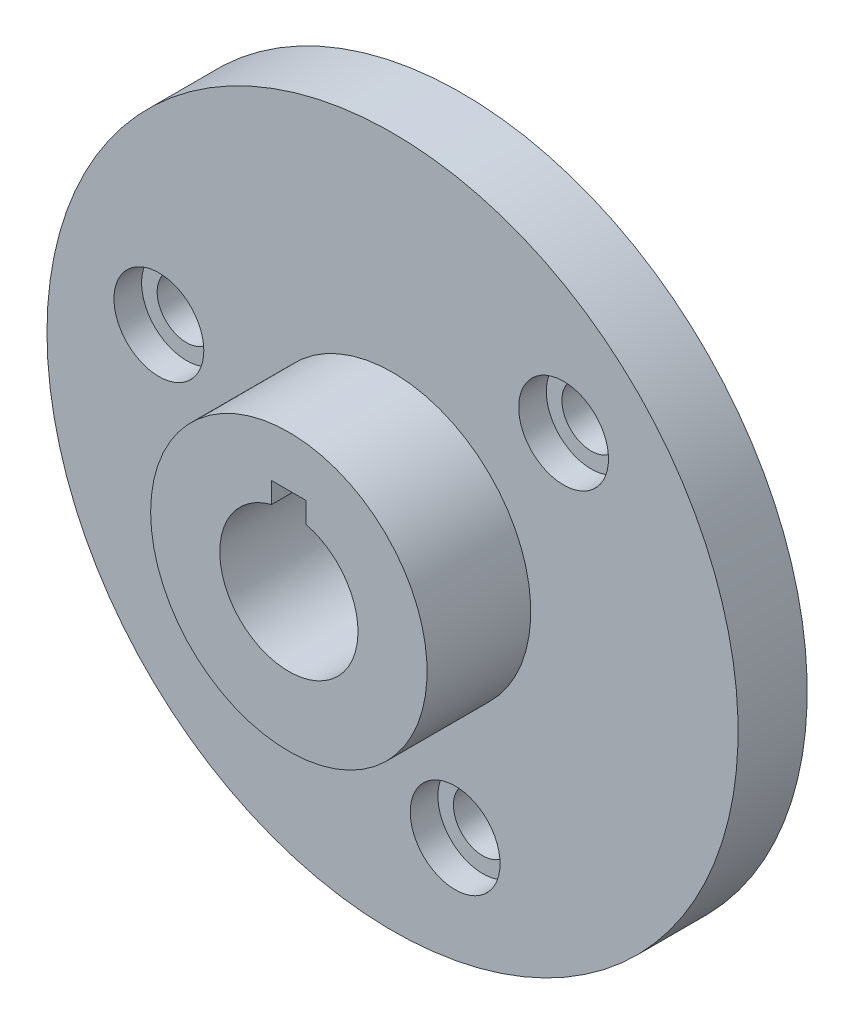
ISO-10303-21;
HEADER;
FILE_DESCRIPTION(('STEP AP214'),'2;1');
FILE_NAME('part.step','',(''),(''),'','','');
FILE_SCHEMA(('AUTOMOTIVE_DESIGN { 1 0 10303 214 1 1 1 1 }'));
ENDSEC;
DATA;
#1=APPLICATION_CONTEXT('core data for automotive mechanical design processes');
#2=APPLICATION_PROTOCOL_DEFINITION('international standard','automotive_design',2000,#1);
#3=PRODUCT_CONTEXT('',#1,'mechanical');
#4=PRODUCT('Part','Part','',(#3));
#5=PRODUCT_RELATED_PRODUCT_CATEGORY('part','',(#4));
#6=PRODUCT_DEFINITION_FORMATION('','',#4);
#7=PRODUCT_DEFINITION_CONTEXT('part definition',#1,'design');
#8=PRODUCT_DEFINITION('design','',#6,#7);
#9=PRODUCT_DEFINITION_SHAPE('','',#8);
#10=(LENGTH_UNIT() NAMED_UNIT(*) SI_UNIT(.MILLI.,.METRE.));
#11=(NAMED_UNIT(*) PLANE_ANGLE_UNIT() SI_UNIT($,.RADIAN.));
#12=(NAMED_UNIT(*) SI_UNIT($,.STERADIAN.) SOLID_ANGLE_UNIT());
#13=UNCERTAINTY_MEASURE_WITH_UNIT(LENGTH_MEASURE(1.E-05),#10,'distance_accuracy_value','');
#14=(GEOMETRIC_REPRESENTATION_CONTEXT(3) GLOBAL_UNCERTAINTY_ASSIGNED_CONTEXT((#13)) GLOBAL_UNIT_ASSIGNED_CONTEXT((#10,
#11,#12)) REPRESENTATION_CONTEXT('',''));
#15=CARTESIAN_POINT('',(0.,0.,0.));
#16=DIRECTION('',(0.,0.,1.));
#17=DIRECTION('',(1.,0.,0.));
#18=AXIS2_PLACEMENT_3D('',#15,#16,#17);
#19=CARTESIAN_POINT('',(0.,0.,0.));
#20=DIRECTION('',(0.,0.,-1.));
#21=DIRECTION('',(-1.,0.,0.));
#22=AXIS2_PLACEMENT_3D('',#19,#20,#21);
#23=PLANE('',#22);
#24=CARTESIAN_POINT('',(0.,0.,0.));
#25=DIRECTION('',(0.,0.,1.));
#26=DIRECTION('',(1.,0.,0.));
#27=AXIS2_PLACEMENT_3D('',#24,#25,#26);
#28=CIRCLE('',#27,10.);
#29=CARTESIAN_POINT('',(-2.5,9.68245836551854,0.));
#30=VERTEX_POINT('',#29);
#31=CARTESIAN_POINT('',(2.5,9.68245836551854,0.));
#32=VERTEX_POINT('',#31);
#33=EDGE_CURVE('E142',#30,#32,#28,.T.);
#34=ORIENTED_EDGE('',*,*,#33,.F.);
#35=DIRECTION('',(0.,-1.,0.));
#36=VECTOR('',#35,1.);
#37=CARTESIAN_POINT('',(-2.5,9.68245836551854,0.));
#38=LINE('',#37,#36);
#39=CARTESIAN_POINT('',(-2.5,12.6824583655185,0.));
#40=VERTEX_POINT('',#39);
#41=EDGE_CURVE('E72',#40,#30,#38,.T.);
#42=ORIENTED_EDGE('',*,*,#41,.F.);
#43=DIRECTION('',(-1.,0.,0.));
#44=VECTOR('',#43,1.);
#45=CARTESIAN_POINT('',(2.5,12.6824583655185,0.));
#46=LINE('',#45,#44);
#47=CARTESIAN_POINT('',(2.5,12.6824583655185,0.));
#48=VERTEX_POINT('',#47);
#49=EDGE_CURVE('E97',#48,#40,#46,.T.);
#50=ORIENTED_EDGE('',*,*,#49,.F.);
#51=DIRECTION('',(0.,1.,0.));
#52=VECTOR('',#51,1.);
#53=CARTESIAN_POINT('',(2.5,9.68245836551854,0.));
#54=LINE('',#53,#52);
#55=EDGE_CURVE('E78',#32,#48,#54,.T.);
#56=ORIENTED_EDGE('',*,*,#55,.F.);
#57=EDGE_LOOP('',(#34,#42,#50,#56));
#58=FACE_BOUND('',#57,.T.);
#59=CARTESIAN_POINT('',(0.,0.,0.));
#60=DIRECTION('',(0.,0.,-1.));
#61=DIRECTION('',(-1.,0.,0.));
#62=AXIS2_PLACEMENT_3D('',#59,#60,#61);
#63=CIRCLE('',#62,20.);
#64=CARTESIAN_POINT('',(-20.,0.,0.));
#65=VERTEX_POINT('',#64);
#66=EDGE_CURVE('E11',#65,#65,#63,.T.);
#67=ORIENTED_EDGE('',*,*,#66,.F.);
#68=EDGE_LOOP('',(#67));
#69=FACE_BOUND('',#68,.T.);
#70=ADVANCED_FACE('F33',(#58,#69),#23,.F.);
#71=CARTESIAN_POINT('',(0.,0.,0.));
#72=DIRECTION('',(0.,0.,-1.));
#73=DIRECTION('',(-1.,0.,0.));
#74=AXIS2_PLACEMENT_3D('',#71,#72,#73);
#75=CYLINDRICAL_SURFACE('',#74,20.);
#76=CARTESIAN_POINT('',(0.,0.,-15.));
#77=DIRECTION('',(0.,0.,-1.));
#78=DIRECTION('',(-1.,0.,0.));
#79=AXIS2_PLACEMENT_3D('',#76,#77,#78);
#80=CIRCLE('',#79,20.);
#81=CARTESIAN_POINT('',(-20.,0.,-15.));
#82=VERTEX_POINT('',#81);
#83=EDGE_CURVE('E40',#82,#82,#80,.T.);
#84=ORIENTED_EDGE('',*,*,#83,.F.);
#85=EDGE_LOOP('',(#84));
#86=FACE_BOUND('',#85,.T.);
#87=ORIENTED_EDGE('',*,*,#66,.T.);
#88=EDGE_LOOP('',(#87));
#89=FACE_BOUND('',#88,.T.);
#90=ADVANCED_FACE('F156',(#86,#89),#75,.T.);
#91=CARTESIAN_POINT('',(0.,20.,-15.));
#92=DIRECTION('',(0.,0.,-1.));
#93=DIRECTION('',(-1.,0.,0.));
#94=AXIS2_PLACEMENT_3D('',#91,#92,#93);
#95=PLANE('',#94);
#96=CARTESIAN_POINT('',(24.7487373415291,24.7487373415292,-15.));
#97=DIRECTION('',(0.,0.,1.));
#98=DIRECTION('',(1.,0.,0.));
#99=AXIS2_PLACEMENT_3D('',#96,#97,#98);
#100=CIRCLE('',#99,6.5);
#101=CARTESIAN_POINT('',(31.2487373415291,24.7487373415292,-15.));
#102=VERTEX_POINT('',#101);
#103=EDGE_CURVE('E104',#102,#102,#100,.T.);
#104=ORIENTED_EDGE('',*,*,#103,.F.);
#105=EDGE_LOOP('',(#104));
#106=FACE_BOUND('',#105,.T.);
#107=CARTESIAN_POINT('',(9.0586665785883,-33.8074039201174,-15.));
#108=DIRECTION('',(0.,0.,1.));
#109=DIRECTION('',(1.,0.,0.));
#110=AXIS2_PLACEMENT_3D('',#107,#108,#109);
#111=CIRCLE('',#110,6.5);
#112=CARTESIAN_POINT('',(15.5586665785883,-33.8074039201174,-15.));
#113=VERTEX_POINT('',#112);
#114=EDGE_CURVE('E118',#113,#113,#111,.T.);
#115=ORIENTED_EDGE('',*,*,#114,.F.);
#116=EDGE_LOOP('',(#115));
#117=FACE_BOUND('',#116,.T.);
#118=CARTESIAN_POINT('',(-33.8074039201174,9.05866657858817,-15.));
#119=DIRECTION('',(0.,0.,1.));
#120=DIRECTION('',(1.,0.,0.));
#121=AXIS2_PLACEMENT_3D('',#118,#119,#120);
#122=CIRCLE('',#121,6.5);
#123=CARTESIAN_POINT('',(-27.3074039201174,9.05866657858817,-15.));
#124=VERTEX_POINT('',#123);
#125=EDGE_CURVE('E130',#124,#124,#122,.T.);
#126=ORIENTED_EDGE('',*,*,#125,.F.);
#127=EDGE_LOOP('',(#126));
#128=FACE_BOUND('',#127,.T.);
#129=CARTESIAN_POINT('',(0.,0.,-15.));
#130=DIRECTION('',(0.,0.,-1.));
#131=DIRECTION('',(-1.,0.,0.));
#132=AXIS2_PLACEMENT_3D('',#129,#130,#131);
#133=CIRCLE('',#132,50.);
#134=CARTESIAN_POINT('',(-50.,0.,-15.));
#135=VERTEX_POINT('',#134);
#136=EDGE_CURVE('E149',#135,#135,#133,.T.);
#137=ORIENTED_EDGE('',*,*,#136,.F.);
#138=EDGE_LOOP('',(#137));
#139=FACE_BOUND('',#138,.T.);
#140=ORIENTED_EDGE('',*,*,#83,.T.);
#141=EDGE_LOOP('',(#140));
#142=FACE_BOUND('',#141,.T.);
#143=ADVANCED_FACE('F154',(#106,#117,#128,#139,#142),#95,.F.);
#144=CARTESIAN_POINT('',(0.,0.,0.));
#145=DIRECTION('',(0.,0.,-1.));
#146=DIRECTION('',(-1.,0.,0.));
#147=AXIS2_PLACEMENT_3D('',#144,#145,#146);
#148=CYLINDRICAL_SURFACE('',#147,50.);
#149=CARTESIAN_POINT('',(0.,0.,-25.));
#150=DIRECTION('',(0.,0.,-1.));
#151=DIRECTION('',(-1.,0.,0.));
#152=AXIS2_PLACEMENT_3D('',#149,#150,#151);
#153=CIRCLE('',#152,50.);
#154=CARTESIAN_POINT('',(-50.,0.,-25.));
#155=VERTEX_POINT('',#154);
#156=EDGE_CURVE('E144',#155,#155,#153,.T.);
#157=ORIENTED_EDGE('',*,*,#156,.F.);
#158=EDGE_LOOP('',(#157));
#159=FACE_BOUND('',#158,.T.);
#160=ORIENTED_EDGE('',*,*,#136,.T.);
#161=EDGE_LOOP('',(#160));
#162=FACE_BOUND('',#161,.T.);
#163=ADVANCED_FACE('F178',(#159,#162),#148,.T.);
#164=CARTESIAN_POINT('',(0.,50.,-25.));
#165=DIRECTION('',(0.,0.,1.));
#166=DIRECTION('',(1.,0.,0.));
#167=AXIS2_PLACEMENT_3D('',#164,#165,#166);
#168=PLANE('',#167);
#169=CARTESIAN_POINT('',(24.7487373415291,24.7487373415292,-25.));
#170=DIRECTION('',(0.,0.,1.));
#171=DIRECTION('',(1.,0.,0.));
#172=AXIS2_PLACEMENT_3D('',#169,#170,#171);
#173=CIRCLE('',#172,4.25);
#174=CARTESIAN_POINT('',(28.9987373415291,24.7487373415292,-25.));
#175=VERTEX_POINT('',#174);
#176=EDGE_CURVE('E115',#175,#175,#173,.T.);
#177=ORIENTED_EDGE('',*,*,#176,.T.);
#178=EDGE_LOOP('',(#177));
#179=FACE_BOUND('',#178,.T.);
#180=CARTESIAN_POINT('',(9.0586665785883,-33.8074039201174,-25.));
#181=DIRECTION('',(0.,0.,1.));
#182=DIRECTION('',(1.,0.,0.));
#183=AXIS2_PLACEMENT_3D('',#180,#181,#182);
#184=CIRCLE('',#183,4.25);
#185=CARTESIAN_POINT('',(13.3086665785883,-33.8074039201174,-25.));
#186=VERTEX_POINT('',#185);
#187=EDGE_CURVE('E127',#186,#186,#184,.T.);
#188=ORIENTED_EDGE('',*,*,#187,.T.);
#189=EDGE_LOOP('',(#188));
#190=FACE_BOUND('',#189,.T.);
#191=CARTESIAN_POINT('',(-33.8074039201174,9.05866657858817,-25.));
#192=DIRECTION('',(0.,0.,1.));
#193=DIRECTION('',(1.,0.,0.));
#194=AXIS2_PLACEMENT_3D('',#191,#192,#193);
#195=CIRCLE('',#194,4.25);
#196=CARTESIAN_POINT('',(-29.5574039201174,9.05866657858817,-25.));
#197=VERTEX_POINT('',#196);
#198=EDGE_CURVE('E139',#197,#197,#195,.T.);
#199=ORIENTED_EDGE('',*,*,#198,.T.);
#200=EDGE_LOOP('',(#199));
#201=FACE_BOUND('',#200,.T.);
#202=DIRECTION('',(-1.,0.,0.));
#203=VECTOR('',#202,1.);
#204=CARTESIAN_POINT('',(2.5,12.6824583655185,-25.));
#205=LINE('',#204,#203);
#206=CARTESIAN_POINT('',(2.5,12.6824583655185,-25.));
#207=VERTEX_POINT('',#206);
#208=CARTESIAN_POINT('',(-2.5,12.6824583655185,-25.));
#209=VERTEX_POINT('',#208);
#210=EDGE_CURVE('E86',#207,#209,#205,.T.);
#211=ORIENTED_EDGE('',*,*,#210,.T.);
#212=DIRECTION('',(0.,-1.,0.));
#213=VECTOR('',#212,1.);
#214=CARTESIAN_POINT('',(-2.5,9.68245836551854,-25.));
#215=LINE('',#214,#213);
#216=CARTESIAN_POINT('',(-2.5,9.68245836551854,-25.));
#217=VERTEX_POINT('',#216);
#218=EDGE_CURVE('E89',#209,#217,#215,.T.);
#219=ORIENTED_EDGE('',*,*,#218,.T.);
#220=CARTESIAN_POINT('',(0.,0.,-25.));
#221=DIRECTION('',(0.,0.,1.));
#222=DIRECTION('',(1.,0.,0.));
#223=AXIS2_PLACEMENT_3D('',#220,#221,#222);
#224=CIRCLE('',#223,10.);
#225=CARTESIAN_POINT('',(2.5,9.68245836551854,-25.));
#226=VERTEX_POINT('',#225);
#227=EDGE_CURVE('E95',#217,#226,#224,.T.);
#228=ORIENTED_EDGE('',*,*,#227,.T.);
#229=DIRECTION('',(0.,1.,0.));
#230=VECTOR('',#229,1.);
#231=CARTESIAN_POINT('',(2.5,9.68245836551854,-25.));
#232=LINE('',#231,#230);
#233=EDGE_CURVE('E47',#226,#207,#232,.T.);
#234=ORIENTED_EDGE('',*,*,#233,.T.);
#235=EDGE_LOOP('',(#211,#219,#228,#234));
#236=FACE_BOUND('',#235,.T.);
#237=ORIENTED_EDGE('',*,*,#156,.T.);
#238=EDGE_LOOP('',(#237));
#239=FACE_BOUND('',#238,.T.);
#240=ADVANCED_FACE('F92',(#179,#190,#201,#236,#239),#168,.F.);
#241=CARTESIAN_POINT('',(0.,0.,-25.));
#242=DIRECTION('',(0.,0.,1.));
#243=DIRECTION('',(1.,0.,0.));
#244=AXIS2_PLACEMENT_3D('',#241,#242,#243);
#245=CYLINDRICAL_SURFACE('',#244,10.);
#246=ORIENTED_EDGE('',*,*,#227,.F.);
#247=DIRECTION('',(0.,0.,1.));
#248=VECTOR('',#247,1.);
#249=CARTESIAN_POINT('',(-2.5,9.68245836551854,-25.));
#250=LINE('',#249,#248);
#251=EDGE_CURVE('E56',#217,#30,#250,.T.);
#252=ORIENTED_EDGE('',*,*,#251,.T.);
#253=ORIENTED_EDGE('',*,*,#33,.T.);
#254=DIRECTION('',(0.,0.,1.));
#255=VECTOR('',#254,1.);
#256=CARTESIAN_POINT('',(2.5,9.68245836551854,-25.));
#257=LINE('',#256,#255);
#258=EDGE_CURVE('E83',#226,#32,#257,.T.);
#259=ORIENTED_EDGE('',*,*,#258,.F.);
#260=EDGE_LOOP('',(#246,#252,#253,#259));
#261=FACE_BOUND('',#260,.T.);
#262=ADVANCED_FACE('F167',(#261),#245,.F.);
#263=CARTESIAN_POINT('',(-33.8074039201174,9.05866657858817,-15.));
#264=DIRECTION('',(0.,0.,1.));
#265=DIRECTION('',(1.,0.,0.));
#266=AXIS2_PLACEMENT_3D('',#263,#264,#265);
#267=CYLINDRICAL_SURFACE('',#266,4.25);
#268=ORIENTED_EDGE('',*,*,#198,.F.);
#269=EDGE_LOOP('',(#268));
#270=FACE_BOUND('',#269,.T.);
#271=CARTESIAN_POINT('',(-33.8074039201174,9.05866657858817,-19.));
#272=DIRECTION('',(0.,0.,1.));
#273=DIRECTION('',(1.,0.,0.));
#274=AXIS2_PLACEMENT_3D('',#271,#272,#273);
#275=CIRCLE('',#274,4.25000000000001);
#276=CARTESIAN_POINT('',(-29.5574039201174,9.05866657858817,-19.));
#277=VERTEX_POINT('',#276);
#278=EDGE_CURVE('E136',#277,#277,#275,.T.);
#279=ORIENTED_EDGE('',*,*,#278,.T.);
#280=EDGE_LOOP('',(#279));
#281=FACE_BOUND('',#280,.T.);
#282=ADVANCED_FACE('F169',(#270,#281),#267,.F.);
#283=CARTESIAN_POINT('',(-29.5574039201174,9.05866657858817,-19.));
#284=DIRECTION('',(0.,0.,-1.));
#285=DIRECTION('',(-1.,0.,0.));
#286=AXIS2_PLACEMENT_3D('',#283,#284,#285);
#287=PLANE('',#286);
#288=ORIENTED_EDGE('',*,*,#278,.F.);
#289=EDGE_LOOP('',(#288));
#290=FACE_BOUND('',#289,.T.);
#291=CARTESIAN_POINT('',(-33.8074039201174,9.05866657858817,-19.));
#292=DIRECTION('',(0.,0.,1.));
#293=DIRECTION('',(1.,0.,0.));
#294=AXIS2_PLACEMENT_3D('',#291,#292,#293);
#295=CIRCLE('',#294,6.5);
#296=CARTESIAN_POINT('',(-27.3074039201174,9.05866657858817,-19.));
#297=VERTEX_POINT('',#296);
#298=EDGE_CURVE('E133',#297,#297,#295,.T.);
#299=ORIENTED_EDGE('',*,*,#298,.T.);
#300=EDGE_LOOP('',(#299));
#301=FACE_BOUND('',#300,.T.);
#302=ADVANCED_FACE('F175',(#290,#301),#287,.F.);
#303=CARTESIAN_POINT('',(-33.8074039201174,9.05866657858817,-15.));
#304=DIRECTION('',(0.,0.,1.));
#305=DIRECTION('',(1.,0.,0.));
#306=AXIS2_PLACEMENT_3D('',#303,#304,#305);
#307=CYLINDRICAL_SURFACE('',#306,6.5);
#308=ORIENTED_EDGE('',*,*,#298,.F.);
#309=EDGE_LOOP('',(#308));
#310=FACE_BOUND('',#309,.T.);
#311=ORIENTED_EDGE('',*,*,#125,.T.);
#312=EDGE_LOOP('',(#311));
#313=FACE_BOUND('',#312,.T.);
#314=ADVANCED_FACE('F199',(#310,#313),#307,.F.);
#315=CARTESIAN_POINT('',(9.0586665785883,-33.8074039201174,-15.));
#316=DIRECTION('',(0.,0.,1.));
#317=DIRECTION('',(1.,0.,0.));
#318=AXIS2_PLACEMENT_3D('',#315,#316,#317);
#319=CYLINDRICAL_SURFACE('',#318,4.25);
#320=ORIENTED_EDGE('',*,*,#187,.F.);
#321=EDGE_LOOP('',(#320));
#322=FACE_BOUND('',#321,.T.);
#323=CARTESIAN_POINT('',(9.0586665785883,-33.8074039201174,-19.));
#324=DIRECTION('',(0.,0.,1.));
#325=DIRECTION('',(1.,0.,0.));
#326=AXIS2_PLACEMENT_3D('',#323,#324,#325);
#327=CIRCLE('',#326,4.25000000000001);
#328=CARTESIAN_POINT('',(13.3086665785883,-33.8074039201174,-19.));
#329=VERTEX_POINT('',#328);
#330=EDGE_CURVE('E124',#329,#329,#327,.T.);
#331=ORIENTED_EDGE('',*,*,#330,.T.);
#332=EDGE_LOOP('',(#331));
#333=FACE_BOUND('',#332,.T.);
#334=ADVANCED_FACE('F201',(#322,#333),#319,.F.);
#335=CARTESIAN_POINT('',(13.3086665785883,-33.8074039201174,-19.));
#336=DIRECTION('',(0.,0.,-1.));
#337=DIRECTION('',(-1.,0.,0.));
#338=AXIS2_PLACEMENT_3D('',#335,#336,#337);
#339=PLANE('',#338);
#340=ORIENTED_EDGE('',*,*,#330,.F.);
#341=EDGE_LOOP('',(#340));
#342=FACE_BOUND('',#341,.T.);
#343=CARTESIAN_POINT('',(9.0586665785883,-33.8074039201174,-19.));
#344=DIRECTION('',(0.,0.,1.));
#345=DIRECTION('',(1.,0.,0.));
#346=AXIS2_PLACEMENT_3D('',#343,#344,#345);
#347=CIRCLE('',#346,6.5);
#348=CARTESIAN_POINT('',(15.5586665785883,-33.8074039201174,-19.));
#349=VERTEX_POINT('',#348);
#350=EDGE_CURVE('E121',#349,#349,#347,.T.);
#351=ORIENTED_EDGE('',*,*,#350,.T.);
#352=EDGE_LOOP('',(#351));
#353=FACE_BOUND('',#352,.T.);
#354=ADVANCED_FACE('F208',(#342,#353),#339,.F.);
#355=CARTESIAN_POINT('',(9.0586665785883,-33.8074039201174,-15.));
#356=DIRECTION('',(0.,0.,1.));
#357=DIRECTION('',(1.,0.,0.));
#358=AXIS2_PLACEMENT_3D('',#355,#356,#357);
#359=CYLINDRICAL_SURFACE('',#358,6.5);
#360=ORIENTED_EDGE('',*,*,#350,.F.);
#361=EDGE_LOOP('',(#360));
#362=FACE_BOUND('',#361,.T.);
#363=ORIENTED_EDGE('',*,*,#114,.T.);
#364=EDGE_LOOP('',(#363));
#365=FACE_BOUND('',#364,.T.);
#366=ADVANCED_FACE('F216',(#362,#365),#359,.F.);
#367=CARTESIAN_POINT('',(24.7487373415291,24.7487373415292,-15.));
#368=DIRECTION('',(0.,0.,1.));
#369=DIRECTION('',(1.,0.,0.));
#370=AXIS2_PLACEMENT_3D('',#367,#368,#369);
#371=CYLINDRICAL_SURFACE('',#370,4.25000000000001);
#372=ORIENTED_EDGE('',*,*,#176,.F.);
#373=EDGE_LOOP('',(#372));
#374=FACE_BOUND('',#373,.T.);
#375=CARTESIAN_POINT('',(24.7487373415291,24.7487373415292,-19.));
#376=DIRECTION('',(0.,0.,1.));
#377=DIRECTION('',(1.,0.,0.));
#378=AXIS2_PLACEMENT_3D('',#375,#376,#377);
#379=CIRCLE('',#378,4.25000000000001);
#380=CARTESIAN_POINT('',(28.9987373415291,24.7487373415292,-19.));
#381=VERTEX_POINT('',#380);
#382=EDGE_CURVE('E112',#381,#381,#379,.T.);
#383=ORIENTED_EDGE('',*,*,#382,.T.);
#384=EDGE_LOOP('',(#383));
#385=FACE_BOUND('',#384,.T.);
#386=ADVANCED_FACE('F220',(#374,#385),#371,.F.);
#387=CARTESIAN_POINT('',(28.9987373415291,24.7487373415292,-19.));
#388=DIRECTION('',(0.,0.,-1.));
#389=DIRECTION('',(-1.,0.,0.));
#390=AXIS2_PLACEMENT_3D('',#387,#388,#389);
#391=PLANE('',#390);
#392=ORIENTED_EDGE('',*,*,#382,.F.);
#393=EDGE_LOOP('',(#392));
#394=FACE_BOUND('',#393,.T.);
#395=CARTESIAN_POINT('',(24.7487373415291,24.7487373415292,-19.));
#396=DIRECTION('',(0.,0.,1.));
#397=DIRECTION('',(1.,0.,0.));
#398=AXIS2_PLACEMENT_3D('',#395,#396,#397);
#399=CIRCLE('',#398,6.5);
#400=CARTESIAN_POINT('',(31.2487373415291,24.7487373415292,-19.));
#401=VERTEX_POINT('',#400);
#402=EDGE_CURVE('E109',#401,#401,#399,.T.);
#403=ORIENTED_EDGE('',*,*,#402,.T.);
#404=EDGE_LOOP('',(#403));
#405=FACE_BOUND('',#404,.T.);
#406=ADVANCED_FACE('F224',(#394,#405),#391,.F.);
#407=CARTESIAN_POINT('',(24.7487373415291,24.7487373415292,-15.));
#408=DIRECTION('',(0.,0.,1.));
#409=DIRECTION('',(1.,0.,0.));
#410=AXIS2_PLACEMENT_3D('',#407,#408,#409);
#411=CYLINDRICAL_SURFACE('',#410,6.5);
#412=ORIENTED_EDGE('',*,*,#402,.F.);
#413=EDGE_LOOP('',(#412));
#414=FACE_BOUND('',#413,.T.);
#415=ORIENTED_EDGE('',*,*,#103,.T.);
#416=EDGE_LOOP('',(#415));
#417=FACE_BOUND('',#416,.T.);
#418=ADVANCED_FACE('F228',(#414,#417),#411,.F.);
#419=CARTESIAN_POINT('',(-2.5,9.68245836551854,-25.));
#420=DIRECTION('',(-1.,0.,0.));
#421=DIRECTION('',(0.,0.,1.));
#422=AXIS2_PLACEMENT_3D('',#419,#420,#421);
#423=PLANE('',#422);
#424=ORIENTED_EDGE('',*,*,#41,.T.);
#425=ORIENTED_EDGE('',*,*,#251,.F.);
#426=ORIENTED_EDGE('',*,*,#218,.F.);
#427=DIRECTION('',(0.,0.,1.));
#428=VECTOR('',#427,1.);
#429=CARTESIAN_POINT('',(-2.5,12.6824583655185,-25.));
#430=LINE('',#429,#428);
#431=EDGE_CURVE('E82',#209,#40,#430,.T.);
#432=ORIENTED_EDGE('',*,*,#431,.T.);
#433=EDGE_LOOP('',(#424,#425,#426,#432));
#434=FACE_BOUND('',#433,.T.);
#435=ADVANCED_FACE('F232',(#434),#423,.F.);
#436=CARTESIAN_POINT('',(2.5,12.6824583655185,-25.));
#437=DIRECTION('',(0.,1.,0.));
#438=DIRECTION('',(0.,0.,1.));
#439=AXIS2_PLACEMENT_3D('',#436,#437,#438);
#440=PLANE('',#439);
#441=ORIENTED_EDGE('',*,*,#49,.T.);
#442=ORIENTED_EDGE('',*,*,#431,.F.);
#443=ORIENTED_EDGE('',*,*,#210,.F.);
#444=DIRECTION('',(0.,0.,1.));
#445=VECTOR('',#444,1.);
#446=CARTESIAN_POINT('',(2.5,12.6824583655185,-25.));
#447=LINE('',#446,#445);
#448=EDGE_CURVE('E74',#207,#48,#447,.T.);
#449=ORIENTED_EDGE('',*,*,#448,.T.);
#450=EDGE_LOOP('',(#441,#442,#443,#449));
#451=FACE_BOUND('',#450,.T.);
#452=ADVANCED_FACE('F87',(#451),#440,.F.);
#453=CARTESIAN_POINT('',(2.5,9.68245836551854,-25.));
#454=DIRECTION('',(1.,0.,0.));
#455=DIRECTION('',(0.,0.,-1.));
#456=AXIS2_PLACEMENT_3D('',#453,#454,#455);
#457=PLANE('',#456);
#458=ORIENTED_EDGE('',*,*,#55,.T.);
#459=ORIENTED_EDGE('',*,*,#448,.F.);
#460=ORIENTED_EDGE('',*,*,#233,.F.);
#461=ORIENTED_EDGE('',*,*,#258,.T.);
#462=EDGE_LOOP('',(#458,#459,#460,#461));
#463=FACE_BOUND('',#462,.T.);
#464=ADVANCED_FACE('F76',(#463),#457,.F.);
#465=CLOSED_SHELL('',(#70,#90,#143,#163,#240,#262,#282,#302,#314,#334,#354,#366,#386,#406,#418,
#435,#452,#464));
#466=MANIFOLD_SOLID_BREP('B2',#465);
#467=ADVANCED_BREP_SHAPE_REPRESENTATION('',(#18,#466),#14);
#468=SHAPE_DEFINITION_REPRESENTATION(#9,#467);
ENDSEC;
END-ISO-10303-21;
